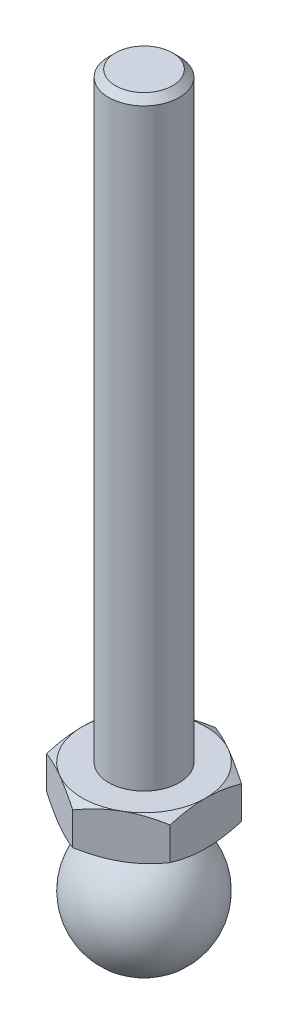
ISO-10303-21;
HEADER;
FILE_DESCRIPTION(('STEP AP214'),'2;1');
FILE_NAME('part.step','',(''),(''),'','','');
FILE_SCHEMA(('AUTOMOTIVE_DESIGN { 1 0 10303 214 1 1 1 1 }'));
ENDSEC;
DATA;
#1=APPLICATION_CONTEXT('core data for automotive mechanical design processes');
#2=APPLICATION_PROTOCOL_DEFINITION('international standard','automotive_design',2000,#1);
#3=PRODUCT_CONTEXT('',#1,'mechanical');
#4=PRODUCT('Part','Part','',(#3));
#5=PRODUCT_RELATED_PRODUCT_CATEGORY('part','',(#4));
#6=PRODUCT_DEFINITION_FORMATION('','',#4);
#7=PRODUCT_DEFINITION_CONTEXT('part definition',#1,'design');
#8=PRODUCT_DEFINITION('design','',#6,#7);
#9=PRODUCT_DEFINITION_SHAPE('','',#8);
#10=(LENGTH_UNIT() NAMED_UNIT(*) SI_UNIT(.MILLI.,.METRE.));
#11=(NAMED_UNIT(*) PLANE_ANGLE_UNIT() SI_UNIT($,.RADIAN.));
#12=(NAMED_UNIT(*) SI_UNIT($,.STERADIAN.) SOLID_ANGLE_UNIT());
#13=UNCERTAINTY_MEASURE_WITH_UNIT(LENGTH_MEASURE(1.E-05),#10,'distance_accuracy_value','');
#14=(GEOMETRIC_REPRESENTATION_CONTEXT(3) GLOBAL_UNCERTAINTY_ASSIGNED_CONTEXT((#13)) GLOBAL_UNIT_ASSIGNED_CONTEXT((#10,
#11,#12)) REPRESENTATION_CONTEXT('',''));
#15=CARTESIAN_POINT('',(0.,0.,0.));
#16=DIRECTION('',(0.,0.,1.));
#17=DIRECTION('',(1.,0.,0.));
#18=AXIS2_PLACEMENT_3D('',#15,#16,#17);
#19=CARTESIAN_POINT('',(0.,12.6,0.));
#20=DIRECTION('',(0.,-1.,0.));
#21=DIRECTION('',(0.,0.,-1.));
#22=AXIS2_PLACEMENT_3D('',#19,#20,#21);
#23=CONICAL_SURFACE('',#22,7.,1.0471975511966);
#24=CARTESIAN_POINT('',(-7.,8.53828268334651,12.1648696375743));
#25=CARTESIAN_POINT('',(-7.,8.68391573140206,11.8738003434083));
#26=CARTESIAN_POINT('',(-7.,8.82854589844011,11.5822239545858));
#27=CARTESIAN_POINT('',(-7.,9.11531569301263,10.997825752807));
#28=CARTESIAN_POINT('',(-7.,9.25745515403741,10.7050038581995));
#29=CARTESIAN_POINT('',(-7.,9.53902214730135,10.1173316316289));
#30=CARTESIAN_POINT('',(-7.,9.67844364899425,9.82247840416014));
#31=CARTESIAN_POINT('',(-7.,9.95360604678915,9.23106328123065));
#32=CARTESIAN_POINT('',(-7.,10.0893470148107,8.93450141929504));
#33=CARTESIAN_POINT('',(-7.,10.3623110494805,8.32593520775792));
#34=CARTESIAN_POINT('',(-7.,10.4993254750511,8.01383696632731));
#35=CARTESIAN_POINT('',(-7.,10.7671383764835,7.38695797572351));
#36=CARTESIAN_POINT('',(-7.,10.8979365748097,7.07217710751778));
#37=CARTESIAN_POINT('',(-7.,11.1515530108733,6.43962449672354));
#38=CARTESIAN_POINT('',(-7.,11.2743761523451,6.12185473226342));
#39=CARTESIAN_POINT('',(-7.,11.5099016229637,5.48260317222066));
#40=CARTESIAN_POINT('',(-7.,11.6226050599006,5.1611217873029));
#41=CARTESIAN_POINT('',(-7.,11.8599014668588,4.43821731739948));
#42=CARTESIAN_POINT('',(-7.,11.981118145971,4.03566892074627));
#43=CARTESIAN_POINT('',(-7.,12.1969740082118,3.22331060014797));
#44=CARTESIAN_POINT('',(-7.,12.2916155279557,2.8135013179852));
#45=CARTESIAN_POINT('',(-7.,12.4069999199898,2.19742561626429));
#46=CARTESIAN_POINT('',(-7.,12.4408518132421,1.99359214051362));
#47=CARTESIAN_POINT('',(-7.,12.4993191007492,1.58461613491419));
#48=CARTESIAN_POINT('',(-7.,12.5239358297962,1.37947379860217));
#49=CARTESIAN_POINT('',(-7.,12.5631968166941,0.968289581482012));
#50=CARTESIAN_POINT('',(-7.,12.5778439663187,0.76224797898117));
#51=CARTESIAN_POINT('',(-7.,12.5967021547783,0.349683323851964));
#52=CARTESIAN_POINT('',(-7.,12.6009132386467,0.143160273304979));
#53=CARTESIAN_POINT('',(-7.,12.5987493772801,-0.271082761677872));
#54=CARTESIAN_POINT('',(-7.,12.5923100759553,-0.47880240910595));
#55=CARTESIAN_POINT('',(-7.,12.5689433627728,-0.893645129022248));
#56=CARTESIAN_POINT('',(-7.,12.5520159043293,-1.10076819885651));
#57=CARTESIAN_POINT('',(-7.,12.5082124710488,-1.51403043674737));
#58=CARTESIAN_POINT('',(-7.,12.4813327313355,-1.72016920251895));
#59=CARTESIAN_POINT('',(-7.,12.4184180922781,-2.13103319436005));
#60=CARTESIAN_POINT('',(-7.,12.382382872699,-2.33575837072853));
#61=CARTESIAN_POINT('',(-7.,12.2605686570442,-2.95437912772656));
#62=CARTESIAN_POINT('',(-7.,12.1618729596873,-3.36575077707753));
#63=CARTESIAN_POINT('',(-7.,11.93845338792,-4.1813801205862));
#64=CARTESIAN_POINT('',(-7.,11.8137148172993,-4.58563365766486));
#65=CARTESIAN_POINT('',(-7.,11.573324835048,-5.30320893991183));
#66=CARTESIAN_POINT('',(-7.,11.4612875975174,-5.61775957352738));
#67=CARTESIAN_POINT('',(-7.,11.2278514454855,-6.24325021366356));
#68=CARTESIAN_POINT('',(-7.,11.1064551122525,-6.55419118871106));
#69=CARTESIAN_POINT('',(-7.,10.8562070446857,-7.17328528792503));
#70=CARTESIAN_POINT('',(-7.,10.7273503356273,-7.48143638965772));
#71=CARTESIAN_POINT('',(-7.,10.4637823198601,-8.09523802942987));
#72=CARTESIAN_POINT('',(-7.,10.3290706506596,-8.4008884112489));
#73=CARTESIAN_POINT('',(-7.,10.0607840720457,-8.99716345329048));
#74=CARTESIAN_POINT('',(-7.,9.92740317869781,-9.28787568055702));
#75=CARTESIAN_POINT('',(-7.,9.65714715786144,-9.86766295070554));
#76=CARTESIAN_POINT('',(-7.,9.52027208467,-10.1567380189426));
#77=CARTESIAN_POINT('',(-7.,9.24389786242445,-10.7329937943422));
#78=CARTESIAN_POINT('',(-7.,9.10440383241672,-11.0201769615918));
#79=CARTESIAN_POINT('',(-7.,8.8230228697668,-11.5933594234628));
#80=CARTESIAN_POINT('',(-7.,8.68113600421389,-11.879358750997));
#81=CARTESIAN_POINT('',(-7.,8.53828268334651,-12.1648696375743));
#82=B_SPLINE_CURVE_WITH_KNOTS('',3,(#24,#25,#26,#27,#28,#29,#30,#31,#32,#33,#34,#35,#36,#37,#38,
#39,#40,#41,#42,#43,#44,#45,#46,#47,#48,#49,#50,#51,#52,#53,#54,#55,#56,#57,#58,#59,#60,#61,#62,
#63,#64,#65,#66,#67,#68,#69,#70,#71,#72,#73,#74,#75,#76,#77,#78,#79,#80,#81),.UNSPECIFIED.,.F.,
.F.,(4,2,2,2,2,2,2,2,2,2,2,2,2,2,2,2,2,2,2,2,2,2,2,2,2,2,2,2,4),(0.,0.976413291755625,
1.9528916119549,2.9313342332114,3.90975772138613,4.93225217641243,5.95479223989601,
6.97669748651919,7.99849072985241,9.25906449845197,10.5195273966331,11.1392271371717,
11.758837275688,12.3782676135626,12.9976952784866,13.6208795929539,14.244066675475,
14.8674897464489,15.4909346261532,16.7587972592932,18.0273773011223,19.0289263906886,
20.0302002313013,21.0321496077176,22.034161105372,22.9936838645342,23.9531917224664,
24.9109871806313,25.8687558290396),.UNSPECIFIED.);
#83=CARTESIAN_POINT('',(-7.,11.9747852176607,4.04145188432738));
#84=VERTEX_POINT('',#83);
#85=CARTESIAN_POINT('',(-7.,12.6,0.));
#86=VERTEX_POINT('',#85);
#87=EDGE_CURVE('E312',#84,#86,#82,.T.);
#88=ORIENTED_EDGE('',*,*,#87,.F.);
#89=CARTESIAN_POINT('',(0.0002,11.9747185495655,8.0830192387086));
#90=CARTESIAN_POINT('',(-0.15366790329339,12.0260001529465,7.99418356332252));
#91=CARTESIAN_POINT('',(-0.308109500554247,12.0749544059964,7.90501666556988));
#92=CARTESIAN_POINT('',(-0.618246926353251,12.1675672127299,7.72595873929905));
#93=CARTESIAN_POINT('',(-0.773943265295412,12.2112234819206,7.63606741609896));
#94=CARTESIAN_POINT('',(-1.24352516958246,12.3333884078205,7.36495417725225));
#95=CARTESIAN_POINT('',(-1.5592643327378,12.4028744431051,7.18266208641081));
#96=CARTESIAN_POINT('',(-2.03176224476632,12.4843550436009,6.9098652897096));
#97=CARTESIAN_POINT('',(-2.18710922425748,12.5075665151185,6.82017566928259));
#98=CARTESIAN_POINT('',(-2.49850511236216,12.5464887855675,6.64039116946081));
#99=CARTESIAN_POINT('',(-2.6545539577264,12.5622002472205,6.55029632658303));
#100=CARTESIAN_POINT('',(-2.96692267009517,12.5857220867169,6.36995016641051));
#101=CARTESIAN_POINT('',(-3.12324202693,12.5935414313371,6.27969914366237));
#102=CARTESIAN_POINT('',(-3.43601650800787,12.6011197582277,6.09911871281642));
#103=CARTESIAN_POINT('',(-3.59247162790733,12.600878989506,6.00878930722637));
#104=CARTESIAN_POINT('',(-4.02110687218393,12.5891402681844,5.76131663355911));
#105=CARTESIAN_POINT('',(-4.29314668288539,12.5694342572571,5.60425437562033));
#106=CARTESIAN_POINT('',(-4.83541944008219,12.5069465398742,5.29117305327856));
#107=CARTESIAN_POINT('',(-5.10565047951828,12.464143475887,5.13515508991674));
#108=CARTESIAN_POINT('',(-5.64901454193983,12.3571483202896,4.82144370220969));
#109=CARTESIAN_POINT('',(-5.92207900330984,12.2925029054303,4.66378986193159));
#110=CARTESIAN_POINT('',(-6.46413578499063,12.145783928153,4.35083323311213));
#111=CARTESIAN_POINT('',(-6.73313504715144,12.0637448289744,4.19552643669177));
#112=CARTESIAN_POINT('',(-7.0002,11.9747185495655,4.04133641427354));
#113=B_SPLINE_CURVE_WITH_KNOTS('',3,(#89,#90,#91,#92,#93,#94,#95,#96,#97,#98,#99,#100,#101,#102,
#103,#104,#105,#106,#107,#108,#109,#110,#111,#112),.UNSPECIFIED.,.F.,.F.,(4,2,2,2,2,2,2,2,2,2,2,
4),(0.,0.554727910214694,1.10969417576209,2.2219327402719,2.76443041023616,3.30688013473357,
3.84871284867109,4.39052882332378,5.33376515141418,6.27787517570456,7.2429241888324,
8.20607866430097),.UNSPECIFIED.);
#114=CARTESIAN_POINT('',(-3.5,12.6,6.06217782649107));
#115=VERTEX_POINT('',#114);
#116=EDGE_CURVE('E138',#115,#84,#113,.T.);
#117=ORIENTED_EDGE('',*,*,#116,.F.);
#118=CARTESIAN_POINT('',(0.,12.6,0.));
#119=DIRECTION('',(0.,-1.,0.));
#120=DIRECTION('',(0.,0.,-1.));
#121=AXIS2_PLACEMENT_3D('',#118,#119,#120);
#122=CIRCLE('',#121,7.);
#123=EDGE_CURVE('E286',#115,#86,#122,.T.);
#124=ORIENTED_EDGE('',*,*,#123,.T.);
#125=EDGE_LOOP('',(#88,#117,#124));
#126=FACE_BOUND('',#125,.T.);
#127=ADVANCED_FACE('F17',(#126),#23,.T.);
#128=CARTESIAN_POINT('',(-7.,11.9747852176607,-4.04145188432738));
#129=VERTEX_POINT('',#128);
#130=EDGE_CURVE('E196',#86,#129,#82,.T.);
#131=ORIENTED_EDGE('',*,*,#130,.F.);
#132=CARTESIAN_POINT('',(-3.5,12.6,-6.06217782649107));
#133=VERTEX_POINT('',#132);
#134=EDGE_CURVE('E198',#86,#133,#122,.T.);
#135=ORIENTED_EDGE('',*,*,#134,.T.);
#136=CARTESIAN_POINT('',(-7.0002,11.9747185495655,-4.04133641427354));
#137=CARTESIAN_POINT('',(-6.84633209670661,12.0260001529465,-4.13017208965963));
#138=CARTESIAN_POINT('',(-6.69189049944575,12.0749544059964,-4.21933898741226));
#139=CARTESIAN_POINT('',(-6.38175307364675,12.1675672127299,-4.39839691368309));
#140=CARTESIAN_POINT('',(-6.22605673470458,12.2112234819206,-4.48828823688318));
#141=CARTESIAN_POINT('',(-5.75647483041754,12.3333884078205,-4.75940147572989));
#142=CARTESIAN_POINT('',(-5.4407356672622,12.4028744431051,-4.94169356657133));
#143=CARTESIAN_POINT('',(-4.96823775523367,12.4843550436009,-5.21449036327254));
#144=CARTESIAN_POINT('',(-4.81289077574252,12.5075665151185,-5.30417998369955));
#145=CARTESIAN_POINT('',(-4.50149488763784,12.5464887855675,-5.48396448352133));
#146=CARTESIAN_POINT('',(-4.3454460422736,12.5622002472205,-5.5740593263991));
#147=CARTESIAN_POINT('',(-4.03307732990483,12.5857220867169,-5.75440548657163));
#148=CARTESIAN_POINT('',(-3.87675797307,12.5935414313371,-5.84465650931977));
#149=CARTESIAN_POINT('',(-3.56398349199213,12.6011197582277,-6.02523694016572));
#150=CARTESIAN_POINT('',(-3.40752837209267,12.600878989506,-6.11556634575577));
#151=CARTESIAN_POINT('',(-2.97889312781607,12.5891402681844,-6.36303901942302));
#152=CARTESIAN_POINT('',(-2.70685331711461,12.5694342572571,-6.52010127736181));
#153=CARTESIAN_POINT('',(-2.16458055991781,12.5069465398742,-6.83318259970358));
#154=CARTESIAN_POINT('',(-1.89434952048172,12.464143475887,-6.9892005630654));
#155=CARTESIAN_POINT('',(-1.35098545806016,12.3571483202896,-7.30291195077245));
#156=CARTESIAN_POINT('',(-1.07792099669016,12.2925029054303,-7.46056579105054));
#157=CARTESIAN_POINT('',(-0.535864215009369,12.145783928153,-7.77352241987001));
#158=CARTESIAN_POINT('',(-0.266864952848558,12.0637448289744,-7.92882921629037));
#159=CARTESIAN_POINT('',(0.000200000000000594,11.9747185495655,-8.0830192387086));
#160=B_SPLINE_CURVE_WITH_KNOTS('',3,(#136,#137,#138,#139,#140,#141,#142,#143,#144,#145,#146,
#147,#148,#149,#150,#151,#152,#153,#154,#155,#156,#157,#158,#159),.UNSPECIFIED.,.F.,.F.,(4,2,2,
2,2,2,2,2,2,2,2,4),(0.,0.554727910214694,1.10969417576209,2.22193274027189,2.76443041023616,
3.30688013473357,3.84871284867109,4.39052882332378,5.33376515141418,6.27787517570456,
7.2429241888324,8.20607866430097),.UNSPECIFIED.);
#161=EDGE_CURVE('E186',#129,#133,#160,.T.);
#162=ORIENTED_EDGE('',*,*,#161,.F.);
#163=EDGE_LOOP('',(#131,#135,#162));
#164=FACE_BOUND('',#163,.T.);
#165=ADVANCED_FACE('F195',(#164),#23,.T.);
#166=CARTESIAN_POINT('',(0.,11.9747852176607,-8.08290376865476));
#167=VERTEX_POINT('',#166);
#168=EDGE_CURVE('E200',#133,#167,#160,.T.);
#169=ORIENTED_EDGE('',*,*,#168,.F.);
#170=CARTESIAN_POINT('',(3.5,12.6,-6.06217782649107));
#171=VERTEX_POINT('',#170);
#172=EDGE_CURVE('E296',#133,#171,#122,.T.);
#173=ORIENTED_EDGE('',*,*,#172,.T.);
#174=CARTESIAN_POINT('',(-0.0002,11.9747185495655,-8.0830192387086));
#175=CARTESIAN_POINT('',(0.15366790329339,12.0260001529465,-7.99418356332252));
#176=CARTESIAN_POINT('',(0.308109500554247,12.0749544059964,-7.90501666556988));
#177=CARTESIAN_POINT('',(0.618246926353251,12.1675672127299,-7.72595873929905));
#178=CARTESIAN_POINT('',(0.773943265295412,12.2112234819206,-7.63606741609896));
#179=CARTESIAN_POINT('',(1.24352516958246,12.3333884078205,-7.36495417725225));
#180=CARTESIAN_POINT('',(1.5592643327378,12.4028744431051,-7.18266208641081));
#181=CARTESIAN_POINT('',(2.03176224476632,12.4843550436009,-6.9098652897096));
#182=CARTESIAN_POINT('',(2.18710922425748,12.5075665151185,-6.82017566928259));
#183=CARTESIAN_POINT('',(2.49850511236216,12.5464887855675,-6.64039116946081));
#184=CARTESIAN_POINT('',(2.6545539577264,12.5622002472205,-6.55029632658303));
#185=CARTESIAN_POINT('',(2.96692267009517,12.5857220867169,-6.36995016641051));
#186=CARTESIAN_POINT('',(3.12324202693,12.5935414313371,-6.27969914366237));
#187=CARTESIAN_POINT('',(3.43601650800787,12.6011197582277,-6.09911871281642));
#188=CARTESIAN_POINT('',(3.59247162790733,12.600878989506,-6.00878930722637));
#189=CARTESIAN_POINT('',(4.02110687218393,12.5891402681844,-5.76131663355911));
#190=CARTESIAN_POINT('',(4.29314668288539,12.5694342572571,-5.60425437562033));
#191=CARTESIAN_POINT('',(4.83541944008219,12.5069465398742,-5.29117305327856));
#192=CARTESIAN_POINT('',(5.10565047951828,12.464143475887,-5.13515508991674));
#193=CARTESIAN_POINT('',(5.64901454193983,12.3571483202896,-4.82144370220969));
#194=CARTESIAN_POINT('',(5.92207900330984,12.2925029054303,-4.66378986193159));
#195=CARTESIAN_POINT('',(6.46413578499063,12.145783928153,-4.35083323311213));
#196=CARTESIAN_POINT('',(6.73313504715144,12.0637448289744,-4.19552643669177));
#197=CARTESIAN_POINT('',(7.0002,11.9747185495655,-4.04133641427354));
#198=B_SPLINE_CURVE_WITH_KNOTS('',3,(#174,#175,#176,#177,#178,#179,#180,#181,#182,#183,#184,
#185,#186,#187,#188,#189,#190,#191,#192,#193,#194,#195,#196,#197),.UNSPECIFIED.,.F.,.F.,(4,2,2,
2,2,2,2,2,2,2,2,4),(0.,0.554727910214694,1.10969417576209,2.2219327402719,2.76443041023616,
3.30688013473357,3.84871284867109,4.39052882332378,5.33376515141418,6.27787517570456,
7.2429241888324,8.20607866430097),.UNSPECIFIED.);
#199=EDGE_CURVE('E246',#167,#171,#198,.T.);
#200=ORIENTED_EDGE('',*,*,#199,.F.);
#201=EDGE_LOOP('',(#169,#173,#200));
#202=FACE_BOUND('',#201,.T.);
#203=ADVANCED_FACE('F345',(#202),#23,.T.);
#204=CARTESIAN_POINT('',(7.,11.9747852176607,-4.04145188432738));
#205=VERTEX_POINT('',#204);
#206=EDGE_CURVE('E241',#171,#205,#198,.T.);
#207=ORIENTED_EDGE('',*,*,#206,.F.);
#208=CARTESIAN_POINT('',(7.,12.6,0.));
#209=VERTEX_POINT('',#208);
#210=EDGE_CURVE('E291',#171,#209,#122,.T.);
#211=ORIENTED_EDGE('',*,*,#210,.T.);
#212=CARTESIAN_POINT('',(7.,8.53828268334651,-12.1648696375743));
#213=CARTESIAN_POINT('',(7.,8.68391573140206,-11.8738003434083));
#214=CARTESIAN_POINT('',(7.,8.82854589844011,-11.5822239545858));
#215=CARTESIAN_POINT('',(7.,9.11531569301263,-10.997825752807));
#216=CARTESIAN_POINT('',(7.,9.25745515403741,-10.7050038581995));
#217=CARTESIAN_POINT('',(7.,9.53902214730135,-10.1173316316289));
#218=CARTESIAN_POINT('',(7.,9.67844364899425,-9.82247840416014));
#219=CARTESIAN_POINT('',(7.,9.95360604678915,-9.23106328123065));
#220=CARTESIAN_POINT('',(7.,10.0893470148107,-8.93450141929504));
#221=CARTESIAN_POINT('',(7.,10.3623110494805,-8.32593520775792));
#222=CARTESIAN_POINT('',(7.,10.4993254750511,-8.01383696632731));
#223=CARTESIAN_POINT('',(7.,10.7671383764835,-7.38695797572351));
#224=CARTESIAN_POINT('',(7.,10.8979365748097,-7.07217710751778));
#225=CARTESIAN_POINT('',(7.,11.1515530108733,-6.43962449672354));
#226=CARTESIAN_POINT('',(7.,11.2743761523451,-6.12185473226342));
#227=CARTESIAN_POINT('',(7.,11.5099016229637,-5.48260317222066));
#228=CARTESIAN_POINT('',(7.,11.6226050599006,-5.1611217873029));
#229=CARTESIAN_POINT('',(7.,11.8599014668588,-4.43821731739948));
#230=CARTESIAN_POINT('',(7.,11.981118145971,-4.03566892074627));
#231=CARTESIAN_POINT('',(7.,12.1969740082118,-3.22331060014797));
#232=CARTESIAN_POINT('',(7.,12.2916155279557,-2.8135013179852));
#233=CARTESIAN_POINT('',(7.,12.4069999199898,-2.19742561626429));
#234=CARTESIAN_POINT('',(7.,12.4408518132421,-1.99359214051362));
#235=CARTESIAN_POINT('',(7.,12.4993191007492,-1.58461613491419));
#236=CARTESIAN_POINT('',(7.,12.5239358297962,-1.37947379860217));
#237=CARTESIAN_POINT('',(7.,12.5631968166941,-0.968289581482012));
#238=CARTESIAN_POINT('',(7.,12.5778439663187,-0.76224797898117));
#239=CARTESIAN_POINT('',(7.,12.5967021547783,-0.349683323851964));
#240=CARTESIAN_POINT('',(7.,12.6009132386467,-0.143160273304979));
#241=CARTESIAN_POINT('',(7.,12.5987493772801,0.271082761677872));
#242=CARTESIAN_POINT('',(7.,12.5923100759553,0.47880240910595));
#243=CARTESIAN_POINT('',(7.,12.5689433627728,0.893645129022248));
#244=CARTESIAN_POINT('',(7.,12.5520159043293,1.10076819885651));
#245=CARTESIAN_POINT('',(7.,12.5082124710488,1.51403043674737));
#246=CARTESIAN_POINT('',(7.,12.4813327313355,1.72016920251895));
#247=CARTESIAN_POINT('',(7.,12.4184180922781,2.13103319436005));
#248=CARTESIAN_POINT('',(7.,12.382382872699,2.33575837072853));
#249=CARTESIAN_POINT('',(7.,12.2605686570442,2.95437912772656));
#250=CARTESIAN_POINT('',(7.,12.1618729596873,3.36575077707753));
#251=CARTESIAN_POINT('',(7.,11.93845338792,4.1813801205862));
#252=CARTESIAN_POINT('',(7.,11.8137148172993,4.58563365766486));
#253=CARTESIAN_POINT('',(7.,11.573324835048,5.30320893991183));
#254=CARTESIAN_POINT('',(7.,11.4612875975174,5.61775957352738));
#255=CARTESIAN_POINT('',(7.,11.2278514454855,6.24325021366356));
#256=CARTESIAN_POINT('',(7.,11.1064551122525,6.55419118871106));
#257=CARTESIAN_POINT('',(7.,10.8562070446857,7.17328528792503));
#258=CARTESIAN_POINT('',(7.,10.7273503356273,7.48143638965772));
#259=CARTESIAN_POINT('',(7.,10.4637823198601,8.09523802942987));
#260=CARTESIAN_POINT('',(7.,10.3290706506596,8.4008884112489));
#261=CARTESIAN_POINT('',(7.,10.0607840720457,8.99716345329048));
#262=CARTESIAN_POINT('',(7.,9.92740317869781,9.28787568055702));
#263=CARTESIAN_POINT('',(7.,9.65714715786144,9.86766295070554));
#264=CARTESIAN_POINT('',(7.,9.52027208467,10.1567380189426));
#265=CARTESIAN_POINT('',(7.,9.24389786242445,10.7329937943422));
#266=CARTESIAN_POINT('',(7.,9.10440383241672,11.0201769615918));
#267=CARTESIAN_POINT('',(7.,8.8230228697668,11.5933594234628));
#268=CARTESIAN_POINT('',(7.,8.68113600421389,11.879358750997));
#269=CARTESIAN_POINT('',(7.,8.53828268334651,12.1648696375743));
#270=B_SPLINE_CURVE_WITH_KNOTS('',3,(#212,#213,#214,#215,#216,#217,#218,#219,#220,#221,#222,
#223,#224,#225,#226,#227,#228,#229,#230,#231,#232,#233,#234,#235,#236,#237,#238,#239,#240,#241,
#242,#243,#244,#245,#246,#247,#248,#249,#250,#251,#252,#253,#254,#255,#256,#257,#258,#259,#260,
#261,#262,#263,#264,#265,#266,#267,#268,#269),.UNSPECIFIED.,.F.,.F.,(4,2,2,2,2,2,2,2,2,2,2,2,2,
2,2,2,2,2,2,2,2,2,2,2,2,2,2,2,4),(0.,0.976413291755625,1.9528916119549,2.9313342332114,
3.90975772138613,4.93225217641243,5.95479223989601,6.97669748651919,7.99849072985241,
9.25906449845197,10.5195273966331,11.1392271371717,11.758837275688,12.3782676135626,
12.9976952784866,13.6208795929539,14.244066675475,14.8674897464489,15.4909346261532,
16.7587972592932,18.0273773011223,19.0289263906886,20.0302002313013,21.0321496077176,
22.034161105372,22.9936838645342,23.9531917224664,24.9109871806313,25.8687558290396),.UNSPECIFIED.);
#271=EDGE_CURVE('E252',#205,#209,#270,.T.);
#272=ORIENTED_EDGE('',*,*,#271,.F.);
#273=EDGE_LOOP('',(#207,#211,#272));
#274=FACE_BOUND('',#273,.T.);
#275=ADVANCED_FACE('F355',(#274),#23,.T.);
#276=CARTESIAN_POINT('',(7.,11.9747852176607,4.04145188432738));
#277=VERTEX_POINT('',#276);
#278=EDGE_CURVE('E254',#209,#277,#270,.T.);
#279=ORIENTED_EDGE('',*,*,#278,.F.);
#280=CARTESIAN_POINT('',(3.5,12.6,6.06217782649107));
#281=VERTEX_POINT('',#280);
#282=EDGE_CURVE('E284',#209,#281,#122,.T.);
#283=ORIENTED_EDGE('',*,*,#282,.T.);
#284=CARTESIAN_POINT('',(7.0002,11.9747185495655,4.04133641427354));
#285=CARTESIAN_POINT('',(6.84633209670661,12.0260001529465,4.13017208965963));
#286=CARTESIAN_POINT('',(6.69189049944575,12.0749544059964,4.21933898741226));
#287=CARTESIAN_POINT('',(6.38175307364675,12.1675672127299,4.39839691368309));
#288=CARTESIAN_POINT('',(6.22605673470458,12.2112234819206,4.48828823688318));
#289=CARTESIAN_POINT('',(5.75647483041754,12.3333884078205,4.75940147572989));
#290=CARTESIAN_POINT('',(5.4407356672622,12.4028744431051,4.94169356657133));
#291=CARTESIAN_POINT('',(4.96823775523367,12.4843550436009,5.21449036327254));
#292=CARTESIAN_POINT('',(4.81289077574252,12.5075665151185,5.30417998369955));
#293=CARTESIAN_POINT('',(4.50149488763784,12.5464887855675,5.48396448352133));
#294=CARTESIAN_POINT('',(4.3454460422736,12.5622002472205,5.5740593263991));
#295=CARTESIAN_POINT('',(4.03307732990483,12.5857220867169,5.75440548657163));
#296=CARTESIAN_POINT('',(3.87675797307,12.5935414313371,5.84465650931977));
#297=CARTESIAN_POINT('',(3.56398349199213,12.6011197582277,6.02523694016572));
#298=CARTESIAN_POINT('',(3.40752837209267,12.600878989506,6.11556634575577));
#299=CARTESIAN_POINT('',(2.97889312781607,12.5891402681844,6.36303901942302));
#300=CARTESIAN_POINT('',(2.70685331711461,12.5694342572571,6.52010127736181));
#301=CARTESIAN_POINT('',(2.16458055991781,12.5069465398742,6.83318259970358));
#302=CARTESIAN_POINT('',(1.89434952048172,12.464143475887,6.9892005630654));
#303=CARTESIAN_POINT('',(1.35098545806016,12.3571483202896,7.30291195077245));
#304=CARTESIAN_POINT('',(1.07792099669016,12.2925029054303,7.46056579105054));
#305=CARTESIAN_POINT('',(0.535864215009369,12.145783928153,7.77352241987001));
#306=CARTESIAN_POINT('',(0.266864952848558,12.0637448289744,7.92882921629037));
#307=CARTESIAN_POINT('',(-0.000200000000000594,11.9747185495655,8.0830192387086));
#308=B_SPLINE_CURVE_WITH_KNOTS('',3,(#284,#285,#286,#287,#288,#289,#290,#291,#292,#293,#294,
#295,#296,#297,#298,#299,#300,#301,#302,#303,#304,#305,#306,#307),.UNSPECIFIED.,.F.,.F.,(4,2,2,
2,2,2,2,2,2,2,2,4),(0.,0.554727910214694,1.10969417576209,2.22193274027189,2.76443041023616,
3.30688013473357,3.84871284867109,4.39052882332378,5.33376515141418,6.27787517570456,
7.2429241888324,8.20607866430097),.UNSPECIFIED.);
#309=EDGE_CURVE('E129',#277,#281,#308,.T.);
#310=ORIENTED_EDGE('',*,*,#309,.F.);
#311=EDGE_LOOP('',(#279,#283,#310));
#312=FACE_BOUND('',#311,.T.);
#313=ADVANCED_FACE('F288',(#312),#23,.T.);
#314=CARTESIAN_POINT('',(0.,11.9747852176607,8.08290376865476));
#315=VERTEX_POINT('',#314);
#316=EDGE_CURVE('E119',#281,#315,#308,.T.);
#317=ORIENTED_EDGE('',*,*,#316,.F.);
#318=EDGE_CURVE('E277',#281,#115,#122,.T.);
#319=ORIENTED_EDGE('',*,*,#318,.T.);
#320=EDGE_CURVE('E32',#315,#115,#113,.T.);
#321=ORIENTED_EDGE('',*,*,#320,.F.);
#322=EDGE_LOOP('',(#317,#319,#321));
#323=FACE_BOUND('',#322,.T.);
#324=ADVANCED_FACE('F276',(#323),#23,.T.);
#325=CARTESIAN_POINT('',(0.,80.6,0.));
#326=DIRECTION('',(0.,-1.,0.));
#327=DIRECTION('',(0.,0.,-1.));
#328=AXIS2_PLACEMENT_3D('',#325,#326,#327);
#329=PLANE('',#328);
#330=CARTESIAN_POINT('',(0.,80.6,0.));
#331=DIRECTION('',(0.,-1.,0.));
#332=DIRECTION('',(0.,0.,-1.));
#333=AXIS2_PLACEMENT_3D('',#330,#331,#332);
#334=CIRCLE('',#333,3.233);
#335=CARTESIAN_POINT('',(0.,80.6,-3.233));
#336=VERTEX_POINT('',#335);
#337=EDGE_CURVE('E25',#336,#336,#334,.T.);
#338=ORIENTED_EDGE('',*,*,#337,.F.);
#339=EDGE_LOOP('',(#338));
#340=FACE_BOUND('',#339,.T.);
#341=ADVANCED_FACE('F19',(#340),#329,.F.);
#342=CARTESIAN_POINT('',(0.,80.6,0.));
#343=DIRECTION('',(0.,-1.,0.));
#344=DIRECTION('',(0.,0.,-1.));
#345=AXIS2_PLACEMENT_3D('',#342,#343,#344);
#346=CONICAL_SURFACE('',#345,3.233,0.785398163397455);
#347=CARTESIAN_POINT('',(0.,79.833,0.));
#348=DIRECTION('',(0.,-1.,0.));
#349=DIRECTION('',(0.,0.,-1.));
#350=AXIS2_PLACEMENT_3D('',#347,#348,#349);
#351=CIRCLE('',#350,4.);
#352=CARTESIAN_POINT('',(0.,79.833,-4.));
#353=VERTEX_POINT('',#352);
#354=EDGE_CURVE('E293',#353,#353,#351,.T.);
#355=ORIENTED_EDGE('',*,*,#354,.F.);
#356=EDGE_LOOP('',(#355));
#357=FACE_BOUND('',#356,.T.);
#358=ORIENTED_EDGE('',*,*,#337,.T.);
#359=EDGE_LOOP('',(#358));
#360=FACE_BOUND('',#359,.T.);
#361=ADVANCED_FACE('F353',(#357,#360),#346,.T.);
#362=CARTESIAN_POINT('',(0.,-7.,0.));
#363=DIRECTION('',(0.,-1.,0.));
#364=DIRECTION('',(0.,0.,-1.));
#365=AXIS2_PLACEMENT_3D('',#362,#363,#364);
#366=CYLINDRICAL_SURFACE('',#365,4.);
#367=CARTESIAN_POINT('',(0.,12.6,0.));
#368=DIRECTION('',(0.,-1.,0.));
#369=DIRECTION('',(0.,0.,-1.));
#370=AXIS2_PLACEMENT_3D('',#367,#368,#369);
#371=CIRCLE('',#370,4.);
#372=CARTESIAN_POINT('',(0.,12.6,-4.));
#373=VERTEX_POINT('',#372);
#374=EDGE_CURVE('E290',#373,#373,#371,.T.);
#375=ORIENTED_EDGE('',*,*,#374,.F.);
#376=EDGE_LOOP('',(#375));
#377=FACE_BOUND('',#376,.T.);
#378=ORIENTED_EDGE('',*,*,#354,.T.);
#379=EDGE_LOOP('',(#378));
#380=FACE_BOUND('',#379,.T.);
#381=ADVANCED_FACE('F430',(#377,#380),#366,.T.);
#382=CARTESIAN_POINT('',(4.,12.6,0.));
#383=DIRECTION('',(0.,-1.,0.));
#384=DIRECTION('',(0.,0.,-1.));
#385=AXIS2_PLACEMENT_3D('',#382,#383,#384);
#386=PLANE('',#385);
#387=ORIENTED_EDGE('',*,*,#282,.F.);
#388=ORIENTED_EDGE('',*,*,#210,.F.);
#389=ORIENTED_EDGE('',*,*,#172,.F.);
#390=ORIENTED_EDGE('',*,*,#134,.F.);
#391=ORIENTED_EDGE('',*,*,#123,.F.);
#392=ORIENTED_EDGE('',*,*,#318,.F.);
#393=EDGE_LOOP('',(#387,#388,#389,#390,#391,#392));
#394=FACE_BOUND('',#393,.T.);
#395=ORIENTED_EDGE('',*,*,#374,.T.);
#396=EDGE_LOOP('',(#395));
#397=FACE_BOUND('',#396,.T.);
#398=ADVANCED_FACE('F281',(#394,#397),#386,.F.);
#399=CARTESIAN_POINT('',(-7.,7.65,-4.04145188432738));
#400=DIRECTION('',(-1.,0.,0.));
#401=DIRECTION('',(0.,0.,1.));
#402=AXIS2_PLACEMENT_3D('',#399,#400,#401);
#403=PLANE('',#402);
#404=ORIENTED_EDGE('',*,*,#87,.T.);
#405=ORIENTED_EDGE('',*,*,#130,.T.);
#406=DIRECTION('',(0.,1.,0.));
#407=VECTOR('',#406,1.);
#408=CARTESIAN_POINT('',(-7.,7.65,-4.04145188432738));
#409=LINE('',#408,#407);
#410=CARTESIAN_POINT('',(-7.,8.27521478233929,-4.04145188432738));
#411=VERTEX_POINT('',#410);
#412=EDGE_CURVE('E112',#411,#129,#409,.T.);
#413=ORIENTED_EDGE('',*,*,#412,.F.);
#414=CARTESIAN_POINT('',(-7.,11.7117173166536,-12.1648696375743));
#415=CARTESIAN_POINT('',(-7.,11.566084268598,-11.8738003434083));
#416=CARTESIAN_POINT('',(-7.,11.42145410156,-11.5822239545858));
#417=CARTESIAN_POINT('',(-7.,11.1346843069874,-10.997825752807));
#418=CARTESIAN_POINT('',(-7.,10.9925448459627,-10.7050038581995));
#419=CARTESIAN_POINT('',(-7.,10.7109778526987,-10.1173316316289));
#420=CARTESIAN_POINT('',(-7.,10.5715563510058,-9.82247840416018));
#421=CARTESIAN_POINT('',(-7.,10.2963939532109,-9.2310632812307));
#422=CARTESIAN_POINT('',(-7.,10.1606529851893,-8.93450141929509));
#423=CARTESIAN_POINT('',(-7.,9.88768895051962,-8.32593520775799));
#424=CARTESIAN_POINT('',(-7.,9.75067452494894,-8.01383696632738));
#425=CARTESIAN_POINT('',(-7.,9.48286162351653,-7.38695797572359));
#426=CARTESIAN_POINT('',(-7.,9.3520634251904,-7.07217710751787));
#427=CARTESIAN_POINT('',(-7.,9.09844698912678,-6.43962449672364));
#428=CARTESIAN_POINT('',(-7.,8.97562384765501,-6.12185473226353));
#429=CARTESIAN_POINT('',(-7.,8.7400983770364,-5.48260317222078));
#430=CARTESIAN_POINT('',(-7.,8.62739494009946,-5.16112178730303));
#431=CARTESIAN_POINT('',(-7.,8.39009853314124,-4.43821731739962));
#432=CARTESIAN_POINT('',(-7.,8.26888185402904,-4.03566892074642));
#433=CARTESIAN_POINT('',(-7.,8.05302599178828,-3.22331060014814));
#434=CARTESIAN_POINT('',(-7.,7.95838447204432,-2.81350131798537));
#435=CARTESIAN_POINT('',(-7.,7.84300008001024,-2.19742561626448));
#436=CARTESIAN_POINT('',(-7.,7.80914818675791,-1.99359214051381));
#437=CARTESIAN_POINT('',(-7.,7.75068089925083,-1.58461613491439));
#438=CARTESIAN_POINT('',(-7.,7.7260641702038,-1.37947379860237));
#439=CARTESIAN_POINT('',(-7.,7.68680318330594,-0.968289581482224));
#440=CARTESIAN_POINT('',(-7.,7.67215603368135,-0.762247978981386));
#441=CARTESIAN_POINT('',(-7.,7.65329784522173,-0.349683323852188));
#442=CARTESIAN_POINT('',(-7.,7.64908676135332,-0.143160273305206));
#443=CARTESIAN_POINT('',(-7.,7.65125062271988,0.27108276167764));
#444=CARTESIAN_POINT('',(-7.,7.65768992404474,0.478802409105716));
#445=CARTESIAN_POINT('',(-7.,7.68105663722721,0.893645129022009));
#446=CARTESIAN_POINT('',(-7.,7.69798409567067,1.10076819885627));
#447=CARTESIAN_POINT('',(-7.,7.74178752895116,1.51403043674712));
#448=CARTESIAN_POINT('',(-7.,7.76866726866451,1.7201692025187));
#449=CARTESIAN_POINT('',(-7.,7.83158190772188,2.1310331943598));
#450=CARTESIAN_POINT('',(-7.,7.86761712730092,2.33575837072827));
#451=CARTESIAN_POINT('',(-7.,7.98943134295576,2.95437912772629));
#452=CARTESIAN_POINT('',(-7.,8.08812704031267,3.36575077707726));
#453=CARTESIAN_POINT('',(-7.,8.31154661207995,4.18138012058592));
#454=CARTESIAN_POINT('',(-7.,8.43628518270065,4.58563365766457));
#455=CARTESIAN_POINT('',(-7.,8.67667516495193,5.30320893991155));
#456=CARTESIAN_POINT('',(-7.,8.78871240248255,5.61775957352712));
#457=CARTESIAN_POINT('',(-7.,9.02214855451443,6.24325021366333));
#458=CARTESIAN_POINT('',(-7.,9.14354488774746,6.55419118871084));
#459=CARTESIAN_POINT('',(-7.,9.3937929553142,7.17328528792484));
#460=CARTESIAN_POINT('',(-7.,9.52264966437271,7.48143638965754));
#461=CARTESIAN_POINT('',(-7.,9.78621768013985,8.09523802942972));
#462=CARTESIAN_POINT('',(-7.,9.92092934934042,8.40088841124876));
#463=CARTESIAN_POINT('',(-7.,10.1892159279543,8.99716345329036));
#464=CARTESIAN_POINT('',(-7.,10.3225968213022,9.28787568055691));
#465=CARTESIAN_POINT('',(-7.,10.5928528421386,9.86766295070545));
#466=CARTESIAN_POINT('',(-7.,10.72972791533,10.1567380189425));
#467=CARTESIAN_POINT('',(-7.,11.0061021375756,10.7329937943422));
#468=CARTESIAN_POINT('',(-7.,11.1455961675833,11.0201769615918));
#469=CARTESIAN_POINT('',(-7.,11.4269771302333,11.5933594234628));
#470=CARTESIAN_POINT('',(-7.,11.5688639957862,11.879358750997));
#471=CARTESIAN_POINT('',(-7.,11.7117173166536,12.1648696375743));
#472=B_SPLINE_CURVE_WITH_KNOTS('',3,(#414,#415,#416,#417,#418,#419,#420,#421,#422,#423,#424,
#425,#426,#427,#428,#429,#430,#431,#432,#433,#434,#435,#436,#437,#438,#439,#440,#441,#442,#443,
#444,#445,#446,#447,#448,#449,#450,#451,#452,#453,#454,#455,#456,#457,#458,#459,#460,#461,#462,
#463,#464,#465,#466,#467,#468,#469,#470,#471),.UNSPECIFIED.,.F.,.F.,(4,2,2,2,2,2,2,2,2,2,2,2,2,
2,2,2,2,2,2,2,2,2,2,2,2,2,2,2,4),(0.,0.976413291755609,1.95289161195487,2.93133423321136,
3.90975772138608,4.93225217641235,5.95479223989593,6.97669748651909,7.99849072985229,
9.25906449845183,10.5195273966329,11.1392271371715,11.7588372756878,12.3782676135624,
12.9976952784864,13.6208795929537,14.2440666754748,14.8674897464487,15.490934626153,
16.758797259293,18.027377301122,19.0289263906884,20.0302002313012,21.0321496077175,
22.0341611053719,22.9936838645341,23.9531917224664,24.9109871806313,25.8687558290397),.UNSPECIFIED.);
#473=CARTESIAN_POINT('',(-7.,7.65,0.));
#474=VERTEX_POINT('',#473);
#475=EDGE_CURVE('E202',#411,#474,#472,.T.);
#476=ORIENTED_EDGE('',*,*,#475,.T.);
#477=CARTESIAN_POINT('',(-7.,8.27521478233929,4.04145188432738));
#478=VERTEX_POINT('',#477);
#479=EDGE_CURVE('E199',#474,#478,#472,.T.);
#480=ORIENTED_EDGE('',*,*,#479,.T.);
#481=DIRECTION('',(0.,1.,0.));
#482=VECTOR('',#481,1.);
#483=CARTESIAN_POINT('',(-7.,7.65,4.04145188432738));
#484=LINE('',#483,#482);
#485=EDGE_CURVE('E121',#478,#84,#484,.T.);
#486=ORIENTED_EDGE('',*,*,#485,.T.);
#487=EDGE_LOOP('',(#404,#405,#413,#476,#480,#486));
#488=FACE_BOUND('',#487,.T.);
#489=ADVANCED_FACE('F227',(#488),#403,.T.);
#490=CARTESIAN_POINT('',(0.,7.65,-8.08290376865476));
#491=DIRECTION('',(-0.5,0.,-0.866025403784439));
#492=DIRECTION('',(-0.866025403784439,0.,0.5));
#493=AXIS2_PLACEMENT_3D('',#490,#491,#492);
#494=PLANE('',#493);
#495=ORIENTED_EDGE('',*,*,#161,.T.);
#496=ORIENTED_EDGE('',*,*,#168,.T.);
#497=DIRECTION('',(0.,1.,0.));
#498=VECTOR('',#497,1.);
#499=CARTESIAN_POINT('',(0.,7.65,-8.08290376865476));
#500=LINE('',#499,#498);
#501=CARTESIAN_POINT('',(0.,8.27521478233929,-8.08290376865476));
#502=VERTEX_POINT('',#501);
#503=EDGE_CURVE('E178',#502,#167,#500,.T.);
#504=ORIENTED_EDGE('',*,*,#503,.F.);
#505=CARTESIAN_POINT('',(0.0002,8.27528145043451,-8.0830192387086));
#506=CARTESIAN_POINT('',(-0.153667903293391,8.22399984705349,-7.99418356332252));
#507=CARTESIAN_POINT('',(-0.308109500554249,8.17504559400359,-7.90501666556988));
#508=CARTESIAN_POINT('',(-0.618246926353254,8.08243278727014,-7.72595873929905));
#509=CARTESIAN_POINT('',(-0.773943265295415,8.03877651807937,-7.63606741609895));
#510=CARTESIAN_POINT('',(-1.24352516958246,7.9166115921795,-7.36495417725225));
#511=CARTESIAN_POINT('',(-1.5592643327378,7.84712555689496,-7.18266208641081));
#512=CARTESIAN_POINT('',(-2.03176224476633,7.7656449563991,-6.9098652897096));
#513=CARTESIAN_POINT('',(-2.18710922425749,7.74243348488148,-6.82017566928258));
#514=CARTESIAN_POINT('',(-2.49850511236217,7.70351121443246,-6.64039116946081));
#515=CARTESIAN_POINT('',(-2.65455395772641,7.68779975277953,-6.55029632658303));
#516=CARTESIAN_POINT('',(-2.96692267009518,7.66427791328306,-6.36995016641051));
#517=CARTESIAN_POINT('',(-3.12324202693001,7.65645856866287,-6.27969914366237));
#518=CARTESIAN_POINT('',(-3.43601650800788,7.64888024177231,-6.09911871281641));
#519=CARTESIAN_POINT('',(-3.59247162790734,7.649121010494,-6.00878930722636));
#520=CARTESIAN_POINT('',(-4.02110687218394,7.66085973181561,-5.76131663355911));
#521=CARTESIAN_POINT('',(-4.2931466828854,7.68056574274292,-5.60425437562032));
#522=CARTESIAN_POINT('',(-4.8354194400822,7.74305346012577,-5.29117305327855));
#523=CARTESIAN_POINT('',(-5.10565047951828,7.78585652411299,-5.13515508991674));
#524=CARTESIAN_POINT('',(-5.64901454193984,7.89285167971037,-4.82144370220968));
#525=CARTESIAN_POINT('',(-5.92207900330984,7.95749709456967,-4.66378986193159));
#526=CARTESIAN_POINT('',(-6.46413578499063,8.10421607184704,-4.35083323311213));
#527=CARTESIAN_POINT('',(-6.73313504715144,8.18625517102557,-4.19552643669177));
#528=CARTESIAN_POINT('',(-7.0002,8.27528145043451,-4.04133641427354));
#529=B_SPLINE_CURVE_WITH_KNOTS('',3,(#505,#506,#507,#508,#509,#510,#511,#512,#513,#514,#515,
#516,#517,#518,#519,#520,#521,#522,#523,#524,#525,#526,#527,#528),.UNSPECIFIED.,.F.,.F.,(4,2,2,
2,2,2,2,2,2,2,2,4),(0.,0.554727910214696,1.10969417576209,2.2219327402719,2.76443041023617,
3.30688013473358,3.8487128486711,4.3905288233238,5.33376515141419,6.27787517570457,
7.2429241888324,8.20607866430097),.UNSPECIFIED.);
#530=CARTESIAN_POINT('',(-3.5,7.65,-6.06217782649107));
#531=VERTEX_POINT('',#530);
#532=EDGE_CURVE('E204',#502,#531,#529,.T.);
#533=ORIENTED_EDGE('',*,*,#532,.T.);
#534=EDGE_CURVE('E189',#531,#411,#529,.T.);
#535=ORIENTED_EDGE('',*,*,#534,.T.);
#536=ORIENTED_EDGE('',*,*,#412,.T.);
#537=EDGE_LOOP('',(#495,#496,#504,#533,#535,#536));
#538=FACE_BOUND('',#537,.T.);
#539=ADVANCED_FACE('F185',(#538),#494,.T.);
#540=CARTESIAN_POINT('',(7.,7.65,-4.04145188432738));
#541=DIRECTION('',(0.5,0.,-0.866025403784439));
#542=DIRECTION('',(-0.866025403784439,0.,-0.5));
#543=AXIS2_PLACEMENT_3D('',#540,#541,#542);
#544=PLANE('',#543);
#545=ORIENTED_EDGE('',*,*,#199,.T.);
#546=ORIENTED_EDGE('',*,*,#206,.T.);
#547=DIRECTION('',(0.,1.,0.));
#548=VECTOR('',#547,1.);
#549=CARTESIAN_POINT('',(7.,7.65,-4.04145188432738));
#550=LINE('',#549,#548);
#551=CARTESIAN_POINT('',(7.,8.27521478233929,-4.04145188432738));
#552=VERTEX_POINT('',#551);
#553=EDGE_CURVE('E175',#552,#205,#550,.T.);
#554=ORIENTED_EDGE('',*,*,#553,.F.);
#555=CARTESIAN_POINT('',(7.0002,8.27528145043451,-4.04133641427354));
#556=CARTESIAN_POINT('',(6.84633209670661,8.22399984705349,-4.13017208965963));
#557=CARTESIAN_POINT('',(6.69189049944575,8.17504559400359,-4.21933898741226));
#558=CARTESIAN_POINT('',(6.38175307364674,8.08243278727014,-4.39839691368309));
#559=CARTESIAN_POINT('',(6.22605673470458,8.03877651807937,-4.48828823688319));
#560=CARTESIAN_POINT('',(5.75647483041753,7.9166115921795,-4.75940147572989));
#561=CARTESIAN_POINT('',(5.4407356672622,7.84712555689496,-4.94169356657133));
#562=CARTESIAN_POINT('',(4.96823775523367,7.7656449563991,-5.21449036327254));
#563=CARTESIAN_POINT('',(4.81289077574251,7.74243348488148,-5.30417998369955));
#564=CARTESIAN_POINT('',(4.50149488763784,7.70351121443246,-5.48396448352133));
#565=CARTESIAN_POINT('',(4.34544604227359,7.68779975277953,-5.57405932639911));
#566=CARTESIAN_POINT('',(4.03307732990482,7.66427791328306,-5.75440548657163));
#567=CARTESIAN_POINT('',(3.87675797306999,7.65645856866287,-5.84465650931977));
#568=CARTESIAN_POINT('',(3.56398349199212,7.64888024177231,-6.02523694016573));
#569=CARTESIAN_POINT('',(3.40752837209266,7.649121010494,-6.11556634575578));
#570=CARTESIAN_POINT('',(2.97889312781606,7.66085973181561,-6.36303901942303));
#571=CARTESIAN_POINT('',(2.7068533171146,7.68056574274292,-6.52010127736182));
#572=CARTESIAN_POINT('',(2.1645805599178,7.74305346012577,-6.83318259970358));
#573=CARTESIAN_POINT('',(1.89434952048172,7.78585652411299,-6.9892005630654));
#574=CARTESIAN_POINT('',(1.35098545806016,7.89285167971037,-7.30291195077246));
#575=CARTESIAN_POINT('',(1.07792099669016,7.95749709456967,-7.46056579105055));
#576=CARTESIAN_POINT('',(0.535864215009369,8.10421607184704,-7.77352241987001));
#577=CARTESIAN_POINT('',(0.266864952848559,8.18625517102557,-7.92882921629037));
#578=CARTESIAN_POINT('',(-0.000199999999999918,8.27528145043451,-8.0830192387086));
#579=B_SPLINE_CURVE_WITH_KNOTS('',3,(#555,#556,#557,#558,#559,#560,#561,#562,#563,#564,#565,
#566,#567,#568,#569,#570,#571,#572,#573,#574,#575,#576,#577,#578),.UNSPECIFIED.,.F.,.F.,(4,2,2,
2,2,2,2,2,2,2,2,4),(0.,0.554727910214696,1.10969417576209,2.2219327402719,2.76443041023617,
3.30688013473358,3.8487128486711,4.39052882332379,5.33376515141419,6.27787517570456,
7.2429241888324,8.20607866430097),.UNSPECIFIED.);
#580=CARTESIAN_POINT('',(3.5,7.65,-6.06217782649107));
#581=VERTEX_POINT('',#580);
#582=EDGE_CURVE('E247',#552,#581,#579,.T.);
#583=ORIENTED_EDGE('',*,*,#582,.T.);
#584=EDGE_CURVE('E235',#581,#502,#579,.T.);
#585=ORIENTED_EDGE('',*,*,#584,.T.);
#586=ORIENTED_EDGE('',*,*,#503,.T.);
#587=EDGE_LOOP('',(#545,#546,#554,#583,#585,#586));
#588=FACE_BOUND('',#587,.T.);
#589=ADVANCED_FACE('F226',(#588),#544,.T.);
#590=CARTESIAN_POINT('',(7.,7.65,4.04145188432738));
#591=DIRECTION('',(1.,0.,0.));
#592=DIRECTION('',(0.,0.,-1.));
#593=AXIS2_PLACEMENT_3D('',#590,#591,#592);
#594=PLANE('',#593);
#595=ORIENTED_EDGE('',*,*,#271,.T.);
#596=ORIENTED_EDGE('',*,*,#278,.T.);
#597=DIRECTION('',(0.,1.,0.));
#598=VECTOR('',#597,1.);
#599=CARTESIAN_POINT('',(7.,7.65,4.04145188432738));
#600=LINE('',#599,#598);
#601=CARTESIAN_POINT('',(7.,8.27521478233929,4.04145188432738));
#602=VERTEX_POINT('',#601);
#603=EDGE_CURVE('E120',#602,#277,#600,.T.);
#604=ORIENTED_EDGE('',*,*,#603,.F.);
#605=CARTESIAN_POINT('',(7.,11.7117173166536,12.1648696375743));
#606=CARTESIAN_POINT('',(7.,11.566084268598,11.8738003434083));
#607=CARTESIAN_POINT('',(7.,11.42145410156,11.5822239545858));
#608=CARTESIAN_POINT('',(7.,11.1346843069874,10.997825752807));
#609=CARTESIAN_POINT('',(7.,10.9925448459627,10.7050038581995));
#610=CARTESIAN_POINT('',(7.,10.7109778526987,10.1173316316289));
#611=CARTESIAN_POINT('',(7.,10.5715563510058,9.82247840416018));
#612=CARTESIAN_POINT('',(7.,10.2963939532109,9.2310632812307));
#613=CARTESIAN_POINT('',(7.,10.1606529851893,8.93450141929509));
#614=CARTESIAN_POINT('',(7.,9.88768895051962,8.32593520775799));
#615=CARTESIAN_POINT('',(7.,9.75067452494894,8.01383696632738));
#616=CARTESIAN_POINT('',(7.,9.48286162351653,7.38695797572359));
#617=CARTESIAN_POINT('',(7.,9.3520634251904,7.07217710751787));
#618=CARTESIAN_POINT('',(7.,9.09844698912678,6.43962449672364));
#619=CARTESIAN_POINT('',(7.,8.97562384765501,6.12185473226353));
#620=CARTESIAN_POINT('',(7.,8.7400983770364,5.48260317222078));
#621=CARTESIAN_POINT('',(7.,8.62739494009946,5.16112178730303));
#622=CARTESIAN_POINT('',(7.,8.39009853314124,4.43821731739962));
#623=CARTESIAN_POINT('',(7.,8.26888185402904,4.03566892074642));
#624=CARTESIAN_POINT('',(7.,8.05302599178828,3.22331060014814));
#625=CARTESIAN_POINT('',(7.,7.95838447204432,2.81350131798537));
#626=CARTESIAN_POINT('',(7.,7.84300008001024,2.19742561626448));
#627=CARTESIAN_POINT('',(7.,7.80914818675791,1.99359214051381));
#628=CARTESIAN_POINT('',(7.,7.75068089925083,1.58461613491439));
#629=CARTESIAN_POINT('',(7.,7.7260641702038,1.37947379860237));
#630=CARTESIAN_POINT('',(7.,7.68680318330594,0.968289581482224));
#631=CARTESIAN_POINT('',(7.,7.67215603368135,0.762247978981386));
#632=CARTESIAN_POINT('',(7.,7.65329784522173,0.349683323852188));
#633=CARTESIAN_POINT('',(7.,7.64908676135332,0.143160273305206));
#634=CARTESIAN_POINT('',(7.,7.65125062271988,-0.27108276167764));
#635=CARTESIAN_POINT('',(7.,7.65768992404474,-0.478802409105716));
#636=CARTESIAN_POINT('',(7.,7.68105663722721,-0.893645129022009));
#637=CARTESIAN_POINT('',(7.,7.69798409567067,-1.10076819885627));
#638=CARTESIAN_POINT('',(7.,7.74178752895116,-1.51403043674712));
#639=CARTESIAN_POINT('',(7.,7.76866726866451,-1.7201692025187));
#640=CARTESIAN_POINT('',(7.,7.83158190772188,-2.1310331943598));
#641=CARTESIAN_POINT('',(7.,7.86761712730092,-2.33575837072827));
#642=CARTESIAN_POINT('',(7.,7.98943134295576,-2.95437912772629));
#643=CARTESIAN_POINT('',(7.,8.08812704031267,-3.36575077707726));
#644=CARTESIAN_POINT('',(7.,8.31154661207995,-4.18138012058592));
#645=CARTESIAN_POINT('',(7.,8.43628518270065,-4.58563365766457));
#646=CARTESIAN_POINT('',(7.,8.67667516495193,-5.30320893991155));
#647=CARTESIAN_POINT('',(7.,8.78871240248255,-5.61775957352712));
#648=CARTESIAN_POINT('',(7.,9.02214855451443,-6.24325021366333));
#649=CARTESIAN_POINT('',(7.,9.14354488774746,-6.55419118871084));
#650=CARTESIAN_POINT('',(7.,9.3937929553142,-7.17328528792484));
#651=CARTESIAN_POINT('',(7.,9.52264966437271,-7.48143638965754));
#652=CARTESIAN_POINT('',(7.,9.78621768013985,-8.09523802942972));
#653=CARTESIAN_POINT('',(7.,9.92092934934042,-8.40088841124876));
#654=CARTESIAN_POINT('',(7.,10.1892159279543,-8.99716345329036));
#655=CARTESIAN_POINT('',(7.,10.3225968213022,-9.28787568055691));
#656=CARTESIAN_POINT('',(7.,10.5928528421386,-9.86766295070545));
#657=CARTESIAN_POINT('',(7.,10.72972791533,-10.1567380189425));
#658=CARTESIAN_POINT('',(7.,11.0061021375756,-10.7329937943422));
#659=CARTESIAN_POINT('',(7.,11.1455961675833,-11.0201769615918));
#660=CARTESIAN_POINT('',(7.,11.4269771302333,-11.5933594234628));
#661=CARTESIAN_POINT('',(7.,11.5688639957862,-11.879358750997));
#662=CARTESIAN_POINT('',(7.,11.7117173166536,-12.1648696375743));
#663=B_SPLINE_CURVE_WITH_KNOTS('',3,(#605,#606,#607,#608,#609,#610,#611,#612,#613,#614,#615,
#616,#617,#618,#619,#620,#621,#622,#623,#624,#625,#626,#627,#628,#629,#630,#631,#632,#633,#634,
#635,#636,#637,#638,#639,#640,#641,#642,#643,#644,#645,#646,#647,#648,#649,#650,#651,#652,#653,
#654,#655,#656,#657,#658,#659,#660,#661,#662),.UNSPECIFIED.,.F.,.F.,(4,2,2,2,2,2,2,2,2,2,2,2,2,
2,2,2,2,2,2,2,2,2,2,2,2,2,2,2,4),(0.,0.976413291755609,1.95289161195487,2.93133423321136,
3.90975772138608,4.93225217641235,5.95479223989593,6.97669748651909,7.99849072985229,
9.25906449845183,10.5195273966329,11.1392271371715,11.7588372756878,12.3782676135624,
12.9976952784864,13.6208795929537,14.2440666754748,14.8674897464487,15.490934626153,
16.758797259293,18.027377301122,19.0289263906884,20.0302002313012,21.0321496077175,
22.0341611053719,22.9936838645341,23.9531917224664,24.9109871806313,25.8687558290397),.UNSPECIFIED.);
#664=CARTESIAN_POINT('',(7.,7.65,0.));
#665=VERTEX_POINT('',#664);
#666=EDGE_CURVE('E258',#602,#665,#663,.T.);
#667=ORIENTED_EDGE('',*,*,#666,.T.);
#668=EDGE_CURVE('E263',#665,#552,#663,.T.);
#669=ORIENTED_EDGE('',*,*,#668,.T.);
#670=ORIENTED_EDGE('',*,*,#553,.T.);
#671=EDGE_LOOP('',(#595,#596,#604,#667,#669,#670));
#672=FACE_BOUND('',#671,.T.);
#673=ADVANCED_FACE('F156',(#672),#594,.T.);
#674=CARTESIAN_POINT('',(0.,7.65,8.08290376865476));
#675=DIRECTION('',(0.5,0.,0.866025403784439));
#676=DIRECTION('',(0.866025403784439,0.,-0.5));
#677=AXIS2_PLACEMENT_3D('',#674,#675,#676);
#678=PLANE('',#677);
#679=ORIENTED_EDGE('',*,*,#309,.T.);
#680=ORIENTED_EDGE('',*,*,#316,.T.);
#681=DIRECTION('',(0.,1.,0.));
#682=VECTOR('',#681,1.);
#683=CARTESIAN_POINT('',(0.,7.65,8.08290376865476));
#684=LINE('',#683,#682);
#685=CARTESIAN_POINT('',(0.,8.27521478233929,8.08290376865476));
#686=VERTEX_POINT('',#685);
#687=EDGE_CURVE('E107',#686,#315,#684,.T.);
#688=ORIENTED_EDGE('',*,*,#687,.F.);
#689=CARTESIAN_POINT('',(-0.0002,8.27528145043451,8.0830192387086));
#690=CARTESIAN_POINT('',(0.153667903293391,8.22399984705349,7.99418356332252));
#691=CARTESIAN_POINT('',(0.308109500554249,8.17504559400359,7.90501666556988));
#692=CARTESIAN_POINT('',(0.618246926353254,8.08243278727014,7.72595873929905));
#693=CARTESIAN_POINT('',(0.773943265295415,8.03877651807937,7.63606741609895));
#694=CARTESIAN_POINT('',(1.24352516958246,7.9166115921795,7.36495417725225));
#695=CARTESIAN_POINT('',(1.5592643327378,7.84712555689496,7.18266208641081));
#696=CARTESIAN_POINT('',(2.03176224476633,7.7656449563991,6.9098652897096));
#697=CARTESIAN_POINT('',(2.18710922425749,7.74243348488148,6.82017566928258));
#698=CARTESIAN_POINT('',(2.49850511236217,7.70351121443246,6.64039116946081));
#699=CARTESIAN_POINT('',(2.65455395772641,7.68779975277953,6.55029632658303));
#700=CARTESIAN_POINT('',(2.96692267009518,7.66427791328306,6.36995016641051));
#701=CARTESIAN_POINT('',(3.12324202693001,7.65645856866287,6.27969914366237));
#702=CARTESIAN_POINT('',(3.43601650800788,7.64888024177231,6.09911871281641));
#703=CARTESIAN_POINT('',(3.59247162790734,7.649121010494,6.00878930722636));
#704=CARTESIAN_POINT('',(4.02110687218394,7.66085973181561,5.76131663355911));
#705=CARTESIAN_POINT('',(4.2931466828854,7.68056574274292,5.60425437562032));
#706=CARTESIAN_POINT('',(4.8354194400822,7.74305346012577,5.29117305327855));
#707=CARTESIAN_POINT('',(5.10565047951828,7.78585652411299,5.13515508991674));
#708=CARTESIAN_POINT('',(5.64901454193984,7.89285167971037,4.82144370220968));
#709=CARTESIAN_POINT('',(5.92207900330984,7.95749709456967,4.66378986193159));
#710=CARTESIAN_POINT('',(6.46413578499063,8.10421607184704,4.35083323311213));
#711=CARTESIAN_POINT('',(6.73313504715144,8.18625517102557,4.19552643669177));
#712=CARTESIAN_POINT('',(7.0002,8.27528145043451,4.04133641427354));
#713=B_SPLINE_CURVE_WITH_KNOTS('',3,(#689,#690,#691,#692,#693,#694,#695,#696,#697,#698,#699,
#700,#701,#702,#703,#704,#705,#706,#707,#708,#709,#710,#711,#712),.UNSPECIFIED.,.F.,.F.,(4,2,2,
2,2,2,2,2,2,2,2,4),(0.,0.554727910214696,1.10969417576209,2.2219327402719,2.76443041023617,
3.30688013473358,3.8487128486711,4.3905288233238,5.33376515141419,6.27787517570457,
7.2429241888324,8.20607866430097),.UNSPECIFIED.);
#714=CARTESIAN_POINT('',(3.5,7.65,6.06217782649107));
#715=VERTEX_POINT('',#714);
#716=EDGE_CURVE('E116',#686,#715,#713,.T.);
#717=ORIENTED_EDGE('',*,*,#716,.T.);
#718=EDGE_CURVE('E127',#715,#602,#713,.T.);
#719=ORIENTED_EDGE('',*,*,#718,.T.);
#720=ORIENTED_EDGE('',*,*,#603,.T.);
#721=EDGE_LOOP('',(#679,#680,#688,#717,#719,#720));
#722=FACE_BOUND('',#721,.T.);
#723=ADVANCED_FACE('F115',(#722),#678,.T.);
#724=CARTESIAN_POINT('',(-7.,7.65,4.04145188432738));
#725=DIRECTION('',(-0.5,0.,0.866025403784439));
#726=DIRECTION('',(0.866025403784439,0.,0.5));
#727=AXIS2_PLACEMENT_3D('',#724,#725,#726);
#728=PLANE('',#727);
#729=ORIENTED_EDGE('',*,*,#320,.T.);
#730=ORIENTED_EDGE('',*,*,#116,.T.);
#731=ORIENTED_EDGE('',*,*,#485,.F.);
#732=CARTESIAN_POINT('',(-7.0002,8.27528145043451,4.04133641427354));
#733=CARTESIAN_POINT('',(-6.84633209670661,8.22399984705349,4.13017208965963));
#734=CARTESIAN_POINT('',(-6.69189049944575,8.17504559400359,4.21933898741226));
#735=CARTESIAN_POINT('',(-6.38175307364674,8.08243278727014,4.39839691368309));
#736=CARTESIAN_POINT('',(-6.22605673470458,8.03877651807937,4.48828823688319));
#737=CARTESIAN_POINT('',(-5.75647483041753,7.9166115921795,4.75940147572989));
#738=CARTESIAN_POINT('',(-5.4407356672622,7.84712555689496,4.94169356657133));
#739=CARTESIAN_POINT('',(-4.96823775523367,7.7656449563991,5.21449036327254));
#740=CARTESIAN_POINT('',(-4.81289077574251,7.74243348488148,5.30417998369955));
#741=CARTESIAN_POINT('',(-4.50149488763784,7.70351121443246,5.48396448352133));
#742=CARTESIAN_POINT('',(-4.34544604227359,7.68779975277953,5.57405932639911));
#743=CARTESIAN_POINT('',(-4.03307732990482,7.66427791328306,5.75440548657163));
#744=CARTESIAN_POINT('',(-3.87675797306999,7.65645856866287,5.84465650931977));
#745=CARTESIAN_POINT('',(-3.56398349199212,7.64888024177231,6.02523694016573));
#746=CARTESIAN_POINT('',(-3.40752837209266,7.649121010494,6.11556634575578));
#747=CARTESIAN_POINT('',(-2.97889312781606,7.66085973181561,6.36303901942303));
#748=CARTESIAN_POINT('',(-2.7068533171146,7.68056574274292,6.52010127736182));
#749=CARTESIAN_POINT('',(-2.1645805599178,7.74305346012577,6.83318259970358));
#750=CARTESIAN_POINT('',(-1.89434952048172,7.78585652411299,6.9892005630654));
#751=CARTESIAN_POINT('',(-1.35098545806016,7.89285167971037,7.30291195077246));
#752=CARTESIAN_POINT('',(-1.07792099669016,7.95749709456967,7.46056579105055));
#753=CARTESIAN_POINT('',(-0.535864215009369,8.10421607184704,7.77352241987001));
#754=CARTESIAN_POINT('',(-0.266864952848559,8.18625517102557,7.92882921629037));
#755=CARTESIAN_POINT('',(0.000199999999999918,8.27528145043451,8.0830192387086));
#756=B_SPLINE_CURVE_WITH_KNOTS('',3,(#732,#733,#734,#735,#736,#737,#738,#739,#740,#741,#742,
#743,#744,#745,#746,#747,#748,#749,#750,#751,#752,#753,#754,#755),.UNSPECIFIED.,.F.,.F.,(4,2,2,
2,2,2,2,2,2,2,2,4),(0.,0.554727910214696,1.10969417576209,2.2219327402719,2.76443041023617,
3.30688013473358,3.8487128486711,4.39052882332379,5.33376515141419,6.27787517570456,
7.2429241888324,8.20607866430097),.UNSPECIFIED.);
#757=CARTESIAN_POINT('',(-3.5,7.65,6.06217782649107));
#758=VERTEX_POINT('',#757);
#759=EDGE_CURVE('E39',#478,#758,#756,.T.);
#760=ORIENTED_EDGE('',*,*,#759,.T.);
#761=EDGE_CURVE('E104',#758,#686,#756,.T.);
#762=ORIENTED_EDGE('',*,*,#761,.T.);
#763=ORIENTED_EDGE('',*,*,#687,.T.);
#764=EDGE_LOOP('',(#729,#730,#731,#760,#762,#763));
#765=FACE_BOUND('',#764,.T.);
#766=ADVANCED_FACE('F106',(#765),#728,.T.);
#767=CARTESIAN_POINT('',(0.,0.,0.));
#768=DIRECTION('',(0.,-1.,0.));
#769=DIRECTION('',(-1.,0.,0.));
#770=AXIS2_PLACEMENT_3D('',#767,#768,#769);
#771=SPHERICAL_SURFACE('',#770,7.);
#772=CARTESIAN_POINT('',(0.,5.74456264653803,0.));
#773=DIRECTION('',(0.,-1.,0.));
#774=DIRECTION('',(0.,0.,-1.));
#775=AXIS2_PLACEMENT_3D('',#772,#773,#774);
#776=CIRCLE('',#775,4.);
#777=CARTESIAN_POINT('',(0.,5.74456264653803,-4.));
#778=VERTEX_POINT('',#777);
#779=EDGE_CURVE('E11',#778,#778,#776,.F.);
#780=ORIENTED_EDGE('',*,*,#779,.F.);
#781=EDGE_LOOP('',(#780));
#782=FACE_BOUND('',#781,.T.);
#783=ADVANCED_FACE('F163',(#782),#771,.T.);
#784=CARTESIAN_POINT('',(0.,-7.,0.));
#785=DIRECTION('',(0.,-1.,0.));
#786=DIRECTION('',(0.,0.,-1.));
#787=AXIS2_PLACEMENT_3D('',#784,#785,#786);
#788=CYLINDRICAL_SURFACE('',#787,4.);
#789=ORIENTED_EDGE('',*,*,#779,.T.);
#790=EDGE_LOOP('',(#789));
#791=FACE_BOUND('',#790,.T.);
#792=CARTESIAN_POINT('',(0.,7.65,0.));
#793=DIRECTION('',(0.,-1.,0.));
#794=DIRECTION('',(0.,0.,-1.));
#795=AXIS2_PLACEMENT_3D('',#792,#793,#794);
#796=CIRCLE('',#795,4.);
#797=CARTESIAN_POINT('',(0.,7.65,-4.));
#798=VERTEX_POINT('',#797);
#799=EDGE_CURVE('E307',#798,#798,#796,.T.);
#800=ORIENTED_EDGE('',*,*,#799,.T.);
#801=EDGE_LOOP('',(#800));
#802=FACE_BOUND('',#801,.T.);
#803=ADVANCED_FACE('F372',(#791,#802),#788,.T.);
#804=CARTESIAN_POINT('',(0.,8.45829037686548,0.));
#805=DIRECTION('',(0.,1.,0.));
#806=DIRECTION('',(0.,0.,1.));
#807=AXIS2_PLACEMENT_3D('',#804,#805,#806);
#808=CONICAL_SURFACE('',#807,8.4,1.0471975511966);
#809=ORIENTED_EDGE('',*,*,#582,.F.);
#810=ORIENTED_EDGE('',*,*,#668,.F.);
#811=CARTESIAN_POINT('',(0.,7.65,0.));
#812=DIRECTION('',(0.,-1.,0.));
#813=DIRECTION('',(0.,0.,-1.));
#814=AXIS2_PLACEMENT_3D('',#811,#812,#813);
#815=CIRCLE('',#814,7.);
#816=EDGE_CURVE('E300',#581,#665,#815,.T.);
#817=ORIENTED_EDGE('',*,*,#816,.F.);
#818=EDGE_LOOP('',(#809,#810,#817));
#819=FACE_BOUND('',#818,.T.);
#820=ADVANCED_FACE('F150',(#819),#808,.T.);
#821=ORIENTED_EDGE('',*,*,#584,.F.);
#822=EDGE_CURVE('E306',#531,#581,#815,.T.);
#823=ORIENTED_EDGE('',*,*,#822,.F.);
#824=ORIENTED_EDGE('',*,*,#532,.F.);
#825=EDGE_LOOP('',(#821,#823,#824));
#826=FACE_BOUND('',#825,.T.);
#827=ADVANCED_FACE('F369',(#826),#808,.T.);
#828=ORIENTED_EDGE('',*,*,#534,.F.);
#829=EDGE_CURVE('E310',#474,#531,#815,.T.);
#830=ORIENTED_EDGE('',*,*,#829,.F.);
#831=ORIENTED_EDGE('',*,*,#475,.F.);
#832=EDGE_LOOP('',(#828,#830,#831));
#833=FACE_BOUND('',#832,.T.);
#834=ADVANCED_FACE('F326',(#833),#808,.T.);
#835=ORIENTED_EDGE('',*,*,#479,.F.);
#836=EDGE_CURVE('E304',#758,#474,#815,.T.);
#837=ORIENTED_EDGE('',*,*,#836,.F.);
#838=ORIENTED_EDGE('',*,*,#759,.F.);
#839=EDGE_LOOP('',(#835,#837,#838));
#840=FACE_BOUND('',#839,.T.);
#841=ADVANCED_FACE('F323',(#840),#808,.T.);
#842=ORIENTED_EDGE('',*,*,#666,.F.);
#843=ORIENTED_EDGE('',*,*,#718,.F.);
#844=EDGE_CURVE('E297',#665,#715,#815,.T.);
#845=ORIENTED_EDGE('',*,*,#844,.F.);
#846=EDGE_LOOP('',(#842,#843,#845));
#847=FACE_BOUND('',#846,.T.);
#848=ADVANCED_FACE('F330',(#847),#808,.T.);
#849=CARTESIAN_POINT('',(7.,7.65,0.));
#850=DIRECTION('',(0.,1.,0.));
#851=DIRECTION('',(0.,0.,1.));
#852=AXIS2_PLACEMENT_3D('',#849,#850,#851);
#853=PLANE('',#852);
#854=ORIENTED_EDGE('',*,*,#799,.F.);
#855=EDGE_LOOP('',(#854));
#856=FACE_BOUND('',#855,.T.);
#857=ORIENTED_EDGE('',*,*,#816,.T.);
#858=ORIENTED_EDGE('',*,*,#844,.T.);
#859=EDGE_CURVE('E125',#715,#758,#815,.T.);
#860=ORIENTED_EDGE('',*,*,#859,.T.);
#861=ORIENTED_EDGE('',*,*,#836,.T.);
#862=ORIENTED_EDGE('',*,*,#829,.T.);
#863=ORIENTED_EDGE('',*,*,#822,.T.);
#864=EDGE_LOOP('',(#857,#858,#860,#861,#862,#863));
#865=FACE_BOUND('',#864,.T.);
#866=ADVANCED_FACE('F328',(#856,#865),#853,.F.);
#867=ORIENTED_EDGE('',*,*,#716,.F.);
#868=ORIENTED_EDGE('',*,*,#761,.F.);
#869=ORIENTED_EDGE('',*,*,#859,.F.);
#870=EDGE_LOOP('',(#867,#868,#869));
#871=FACE_BOUND('',#870,.T.);
#872=ADVANCED_FACE('F123',(#871),#808,.T.);
#873=CLOSED_SHELL('',(#127,#165,#203,#275,#313,#324,#341,#361,#381,#398,#489,#539,#589,#673,
#723,#766,#783,#803,#820,#827,#834,#841,#848,#866,#872));
#874=MANIFOLD_SOLID_BREP('B1',#873);
#875=ADVANCED_BREP_SHAPE_REPRESENTATION('',(#18,#874),#14);
#876=SHAPE_DEFINITION_REPRESENTATION(#9,#875);
ENDSEC;
END-ISO-10303-21;
